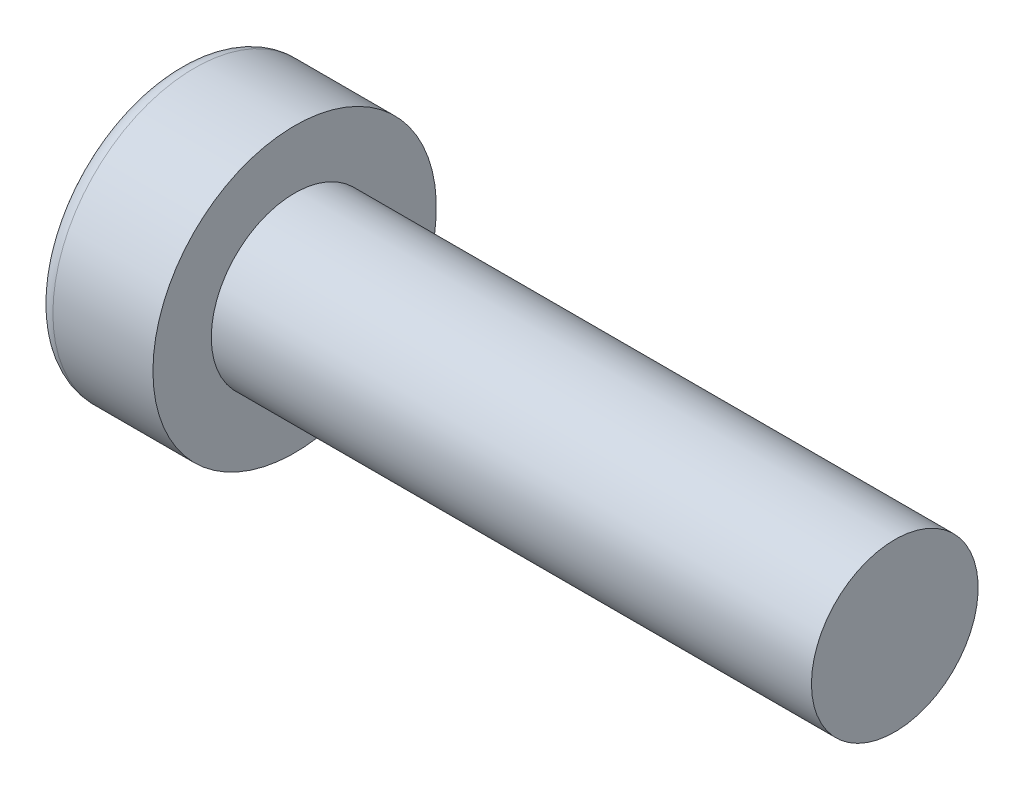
from build123d import *

# Parameters (mm, degrees)
VERRUNDUNG1_R                   = 0.5
SCHNITT_LINEAR_AUSTRAGEN1_DEPTH = 3


with BuildPart() as part:
    # Skizze1 → Rotation1 (revolve)
    with BuildSketch(Plane.XY, mode=Mode.PRIVATE) as rotation1_sk:
        Polygon((-21.5, 0), (-21.5, 4.25), (-18, 4.25), (-18, 2.5), (0, 2.5), (0, 0), align=None)
    revolve(rotation1_sk.sketch.rotate(Axis((-65.011808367, 0, 0), (1, 0, 0)), 90), axis=Axis((-65.011808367, 0, 0), (1, 0, 0)))

    # Verrundung1
    verrundung1_edges = [part.edges().sort_by_distance(p)[0] for p in [
        (-21.5, 0, -4.25),
    ]]
    fillet(verrundung1_edges, radius=VERRUNDUNG1_R)

    # Skizze2 → Schnitt-Linear austragen1 (cut)
    with BuildSketch(Plane.ZY.offset(21.5)):
        Polygon((2, 1.154700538), (0, 2.309401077), (-2, 1.154700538), (-2, -1.154700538), (0, -2.309401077), (2, -1.154700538), align=None)
    extrude(amount=-SCHNITT_LINEAR_AUSTRAGEN1_DEPTH, mode=Mode.SUBTRACT)


solid = part.part
